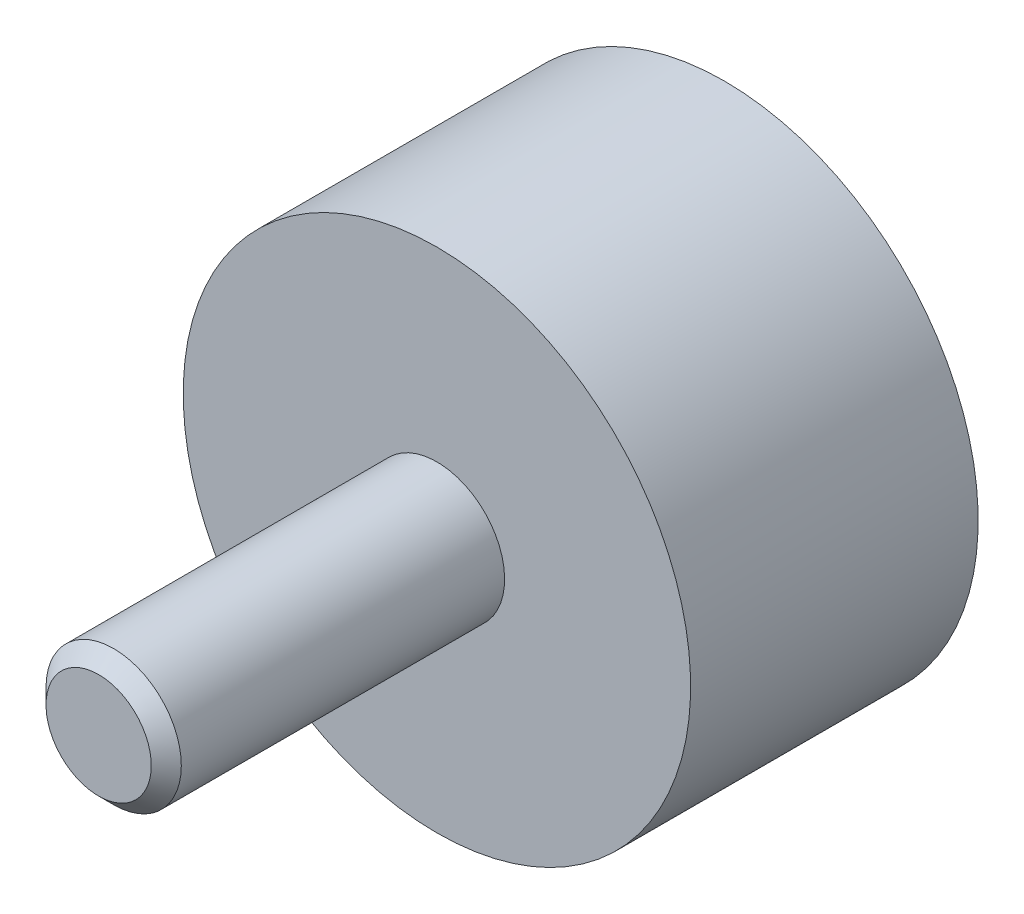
ISO-10303-21;
HEADER;
FILE_DESCRIPTION(('STEP AP214'),'2;1');
FILE_NAME('part.step','',(''),(''),'','','');
FILE_SCHEMA(('AUTOMOTIVE_DESIGN { 1 0 10303 214 1 1 1 1 }'));
ENDSEC;
DATA;
#1=APPLICATION_CONTEXT('core data for automotive mechanical design processes');
#2=APPLICATION_PROTOCOL_DEFINITION('international standard','automotive_design',2000,#1);
#3=PRODUCT_CONTEXT('',#1,'mechanical');
#4=PRODUCT('Part','Part','',(#3));
#5=PRODUCT_RELATED_PRODUCT_CATEGORY('part','',(#4));
#6=PRODUCT_DEFINITION_FORMATION('','',#4);
#7=PRODUCT_DEFINITION_CONTEXT('part definition',#1,'design');
#8=PRODUCT_DEFINITION('design','',#6,#7);
#9=PRODUCT_DEFINITION_SHAPE('','',#8);
#10=(LENGTH_UNIT() NAMED_UNIT(*) SI_UNIT(.MILLI.,.METRE.));
#11=(NAMED_UNIT(*) PLANE_ANGLE_UNIT() SI_UNIT($,.RADIAN.));
#12=(NAMED_UNIT(*) SI_UNIT($,.STERADIAN.) SOLID_ANGLE_UNIT());
#13=UNCERTAINTY_MEASURE_WITH_UNIT(LENGTH_MEASURE(1.E-05),#10,'distance_accuracy_value','');
#14=(GEOMETRIC_REPRESENTATION_CONTEXT(3) GLOBAL_UNCERTAINTY_ASSIGNED_CONTEXT((#13)) GLOBAL_UNIT_ASSIGNED_CONTEXT((#10,
#11,#12)) REPRESENTATION_CONTEXT('',''));
#15=CARTESIAN_POINT('',(0.,0.,0.));
#16=DIRECTION('',(0.,0.,1.));
#17=DIRECTION('',(1.,0.,0.));
#18=AXIS2_PLACEMENT_3D('',#15,#16,#17);
#19=CARTESIAN_POINT('',(0.,0.,0.));
#20=DIRECTION('',(0.,0.,1.));
#21=DIRECTION('',(0.,-1.,0.));
#22=AXIS2_PLACEMENT_3D('',#19,#20,#21);
#23=CYLINDRICAL_SURFACE('',#22,15.);
#24=CARTESIAN_POINT('',(0.,0.,0.));
#25=DIRECTION('',(0.,0.,1.));
#26=DIRECTION('',(0.,-1.,0.));
#27=AXIS2_PLACEMENT_3D('',#24,#25,#26);
#28=CIRCLE('',#27,15.);
#29=CARTESIAN_POINT('',(0.,-15.,0.));
#30=VERTEX_POINT('',#29);
#31=EDGE_CURVE('E18',#30,#30,#28,.T.);
#32=ORIENTED_EDGE('',*,*,#31,.T.);
#33=EDGE_LOOP('',(#32));
#34=FACE_BOUND('',#33,.T.);
#35=CARTESIAN_POINT('',(0.,0.,17.));
#36=DIRECTION('',(0.,0.,-1.));
#37=DIRECTION('',(0.,1.,0.));
#38=AXIS2_PLACEMENT_3D('',#35,#36,#37);
#39=CIRCLE('',#38,15.);
#40=CARTESIAN_POINT('',(0.,15.,17.));
#41=VERTEX_POINT('',#40);
#42=EDGE_CURVE('E22',#41,#41,#39,.T.);
#43=ORIENTED_EDGE('',*,*,#42,.T.);
#44=EDGE_LOOP('',(#43));
#45=FACE_BOUND('',#44,.T.);
#46=ADVANCED_FACE('F12',(#34,#45),#23,.T.);
#47=CARTESIAN_POINT('',(15.,0.,0.));
#48=DIRECTION('',(0.,0.,-1.));
#49=DIRECTION('',(0.,1.,0.));
#50=AXIS2_PLACEMENT_3D('',#47,#48,#49);
#51=PLANE('',#50);
#52=ORIENTED_EDGE('',*,*,#31,.F.);
#53=EDGE_LOOP('',(#52));
#54=FACE_BOUND('',#53,.T.);
#55=ADVANCED_FACE('F48',(#54),#51,.T.);
#56=CARTESIAN_POINT('',(15.,0.,17.));
#57=DIRECTION('',(0.,0.,1.));
#58=DIRECTION('',(0.,-1.,0.));
#59=AXIS2_PLACEMENT_3D('',#56,#57,#58);
#60=PLANE('',#59);
#61=CARTESIAN_POINT('',(0.,0.,17.));
#62=DIRECTION('',(0.,0.,1.));
#63=DIRECTION('',(0.,-1.,0.));
#64=AXIS2_PLACEMENT_3D('',#61,#62,#63);
#65=CIRCLE('',#64,4.);
#66=CARTESIAN_POINT('',(0.,-4.,17.));
#67=VERTEX_POINT('',#66);
#68=EDGE_CURVE('E8',#67,#67,#65,.F.);
#69=ORIENTED_EDGE('',*,*,#68,.T.);
#70=EDGE_LOOP('',(#69));
#71=FACE_BOUND('',#70,.T.);
#72=ORIENTED_EDGE('',*,*,#42,.F.);
#73=EDGE_LOOP('',(#72));
#74=FACE_BOUND('',#73,.T.);
#75=ADVANCED_FACE('F52',(#71,#74),#60,.T.);
#76=CARTESIAN_POINT('',(0.,0.,15.));
#77=DIRECTION('',(0.,0.,1.));
#78=DIRECTION('',(0.,-1.,0.));
#79=AXIS2_PLACEMENT_3D('',#76,#77,#78);
#80=CYLINDRICAL_SURFACE('',#79,4.);
#81=ORIENTED_EDGE('',*,*,#68,.F.);
#82=EDGE_LOOP('',(#81));
#83=FACE_BOUND('',#82,.T.);
#84=CARTESIAN_POINT('',(0.,0.,36.1119886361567));
#85=DIRECTION('',(0.,0.,-1.));
#86=DIRECTION('',(0.,1.,0.));
#87=AXIS2_PLACEMENT_3D('',#84,#85,#86);
#88=CIRCLE('',#87,4.);
#89=CARTESIAN_POINT('',(0.,4.,36.1119886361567));
#90=VERTEX_POINT('',#89);
#91=EDGE_CURVE('E26',#90,#90,#88,.T.);
#92=ORIENTED_EDGE('',*,*,#91,.T.);
#93=EDGE_LOOP('',(#92));
#94=FACE_BOUND('',#93,.T.);
#95=ADVANCED_FACE('F45',(#83,#94),#80,.T.);
#96=CARTESIAN_POINT('',(0.,0.,36.1119886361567));
#97=DIRECTION('',(0.,0.,-1.));
#98=DIRECTION('',(0.,1.,0.));
#99=AXIS2_PLACEMENT_3D('',#96,#97,#98);
#100=CONICAL_SURFACE('',#99,4.,0.785398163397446);
#101=CARTESIAN_POINT('',(0.,0.,37.));
#102=DIRECTION('',(0.,0.,-1.));
#103=DIRECTION('',(0.,1.,0.));
#104=AXIS2_PLACEMENT_3D('',#101,#102,#103);
#105=CIRCLE('',#104,3.11198863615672);
#106=CARTESIAN_POINT('',(0.,3.11198863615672,37.));
#107=VERTEX_POINT('',#106);
#108=EDGE_CURVE('E31',#107,#107,#105,.T.);
#109=ORIENTED_EDGE('',*,*,#108,.T.);
#110=EDGE_LOOP('',(#109));
#111=FACE_BOUND('',#110,.T.);
#112=ORIENTED_EDGE('',*,*,#91,.F.);
#113=EDGE_LOOP('',(#112));
#114=FACE_BOUND('',#113,.T.);
#115=ADVANCED_FACE('F35',(#111,#114),#100,.T.);
#116=CARTESIAN_POINT('',(3.11198863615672,0.,37.));
#117=DIRECTION('',(0.,0.,1.));
#118=DIRECTION('',(0.,-1.,0.));
#119=AXIS2_PLACEMENT_3D('',#116,#117,#118);
#120=PLANE('',#119);
#121=ORIENTED_EDGE('',*,*,#108,.F.);
#122=EDGE_LOOP('',(#121));
#123=FACE_BOUND('',#122,.T.);
#124=ADVANCED_FACE('F38',(#123),#120,.T.);
#125=CLOSED_SHELL('',(#46,#55,#75,#95,#115,#124));
#126=MANIFOLD_SOLID_BREP('B1',#125);
#127=ADVANCED_BREP_SHAPE_REPRESENTATION('',(#18,#126),#14);
#128=SHAPE_DEFINITION_REPRESENTATION(#9,#127);
ENDSEC;
END-ISO-10303-21;
